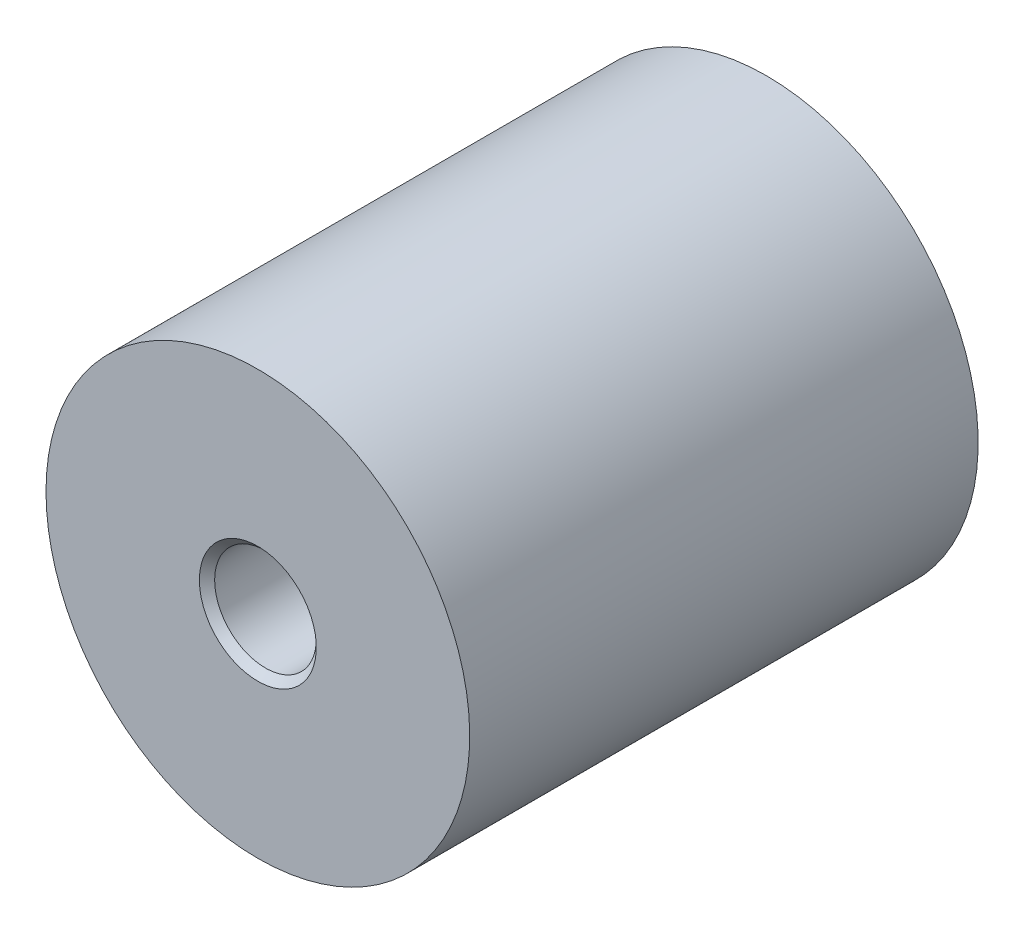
ISO-10303-21;
HEADER;
FILE_DESCRIPTION(('STEP AP214'),'2;1');
FILE_NAME('part.step','',(''),(''),'','','');
FILE_SCHEMA(('AUTOMOTIVE_DESIGN { 1 0 10303 214 1 1 1 1 }'));
ENDSEC;
DATA;
#1=APPLICATION_CONTEXT('core data for automotive mechanical design processes');
#2=APPLICATION_PROTOCOL_DEFINITION('international standard','automotive_design',2000,#1);
#3=PRODUCT_CONTEXT('',#1,'mechanical');
#4=PRODUCT('Part','Part','',(#3));
#5=PRODUCT_RELATED_PRODUCT_CATEGORY('part','',(#4));
#6=PRODUCT_DEFINITION_FORMATION('','',#4);
#7=PRODUCT_DEFINITION_CONTEXT('part definition',#1,'design');
#8=PRODUCT_DEFINITION('design','',#6,#7);
#9=PRODUCT_DEFINITION_SHAPE('','',#8);
#10=(LENGTH_UNIT() NAMED_UNIT(*) SI_UNIT(.MILLI.,.METRE.));
#11=(NAMED_UNIT(*) PLANE_ANGLE_UNIT() SI_UNIT($,.RADIAN.));
#12=(NAMED_UNIT(*) SI_UNIT($,.STERADIAN.) SOLID_ANGLE_UNIT());
#13=UNCERTAINTY_MEASURE_WITH_UNIT(LENGTH_MEASURE(1.E-05),#10,'distance_accuracy_value','');
#14=(GEOMETRIC_REPRESENTATION_CONTEXT(3) GLOBAL_UNCERTAINTY_ASSIGNED_CONTEXT((#13)) GLOBAL_UNIT_ASSIGNED_CONTEXT((#10,
#11,#12)) REPRESENTATION_CONTEXT('',''));
#15=CARTESIAN_POINT('',(0.,0.,0.));
#16=DIRECTION('',(0.,0.,1.));
#17=DIRECTION('',(1.,0.,0.));
#18=AXIS2_PLACEMENT_3D('',#15,#16,#17);
#19=CARTESIAN_POINT('',(0.,0.,0.66666666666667));
#20=DIRECTION('',(0.,0.,1.));
#21=DIRECTION('',(0.,-1.,0.));
#22=AXIS2_PLACEMENT_3D('',#19,#20,#21);
#23=CYLINDRICAL_SURFACE('',#22,12.5);
#24=CARTESIAN_POINT('',(0.,0.,0.));
#25=DIRECTION('',(0.,0.,1.));
#26=DIRECTION('',(0.,-1.,0.));
#27=AXIS2_PLACEMENT_3D('',#24,#25,#26);
#28=CIRCLE('',#27,12.5);
#29=CARTESIAN_POINT('',(0.,-12.5,0.));
#30=VERTEX_POINT('',#29);
#31=EDGE_CURVE('E23',#30,#30,#28,.T.);
#32=ORIENTED_EDGE('',*,*,#31,.T.);
#33=EDGE_LOOP('',(#32));
#34=FACE_BOUND('',#33,.T.);
#35=CARTESIAN_POINT('',(0.,0.,30.));
#36=DIRECTION('',(0.,0.,-1.));
#37=DIRECTION('',(-1.,0.,0.));
#38=AXIS2_PLACEMENT_3D('',#35,#36,#37);
#39=CIRCLE('',#38,12.5);
#40=CARTESIAN_POINT('',(-12.5,0.,30.));
#41=VERTEX_POINT('',#40);
#42=EDGE_CURVE('E32',#41,#41,#39,.T.);
#43=ORIENTED_EDGE('',*,*,#42,.T.);
#44=EDGE_LOOP('',(#43));
#45=FACE_BOUND('',#44,.T.);
#46=ADVANCED_FACE('F12',(#34,#45),#23,.T.);
#47=CARTESIAN_POINT('',(12.5,0.,0.));
#48=DIRECTION('',(0.,0.,-1.));
#49=DIRECTION('',(0.,1.,0.));
#50=AXIS2_PLACEMENT_3D('',#47,#48,#49);
#51=PLANE('',#50);
#52=CARTESIAN_POINT('',(0.,0.,0.));
#53=DIRECTION('',(0.,0.,-1.));
#54=DIRECTION('',(0.,1.,0.));
#55=AXIS2_PLACEMENT_3D('',#52,#53,#54);
#56=CIRCLE('',#55,3.45);
#57=CARTESIAN_POINT('',(0.,3.45,0.));
#58=VERTEX_POINT('',#57);
#59=EDGE_CURVE('E8',#58,#58,#56,.F.);
#60=ORIENTED_EDGE('',*,*,#59,.T.);
#61=EDGE_LOOP('',(#60));
#62=FACE_BOUND('',#61,.T.);
#63=ORIENTED_EDGE('',*,*,#31,.F.);
#64=EDGE_LOOP('',(#63));
#65=FACE_BOUND('',#64,.T.);
#66=ADVANCED_FACE('F58',(#62,#65),#51,.T.);
#67=CARTESIAN_POINT('',(0.,0.,0.));
#68=DIRECTION('',(0.,0.,1.));
#69=DIRECTION('',(0.,-1.,0.));
#70=AXIS2_PLACEMENT_3D('',#67,#68,#69);
#71=CYLINDRICAL_SURFACE('',#70,3.);
#72=CARTESIAN_POINT('',(0.,0.,0.45));
#73=DIRECTION('',(0.,0.,-1.));
#74=DIRECTION('',(0.,1.,0.));
#75=AXIS2_PLACEMENT_3D('',#72,#73,#74);
#76=CIRCLE('',#75,3.);
#77=CARTESIAN_POINT('',(0.,3.,0.45));
#78=VERTEX_POINT('',#77);
#79=EDGE_CURVE('E19',#78,#78,#76,.T.);
#80=ORIENTED_EDGE('',*,*,#79,.T.);
#81=EDGE_LOOP('',(#80));
#82=FACE_BOUND('',#81,.T.);
#83=CARTESIAN_POINT('',(0.,0.,6.));
#84=DIRECTION('',(0.,0.,-1.));
#85=DIRECTION('',(0.,1.,0.));
#86=AXIS2_PLACEMENT_3D('',#83,#84,#85);
#87=CIRCLE('',#86,3.);
#88=CARTESIAN_POINT('',(0.,3.,6.));
#89=VERTEX_POINT('',#88);
#90=EDGE_CURVE('E27',#89,#89,#87,.T.);
#91=ORIENTED_EDGE('',*,*,#90,.F.);
#92=EDGE_LOOP('',(#91));
#93=FACE_BOUND('',#92,.T.);
#94=ADVANCED_FACE('F63',(#82,#93),#71,.F.);
#95=CARTESIAN_POINT('',(0.,0.,6.));
#96=DIRECTION('',(0.,0.,-1.));
#97=DIRECTION('',(0.,1.,0.));
#98=AXIS2_PLACEMENT_3D('',#95,#96,#97);
#99=PLANE('',#98);
#100=ORIENTED_EDGE('',*,*,#90,.T.);
#101=EDGE_LOOP('',(#100));
#102=FACE_BOUND('',#101,.T.);
#103=ADVANCED_FACE('F69',(#102),#99,.T.);
#104=CARTESIAN_POINT('',(0.,0.,0.45));
#105=DIRECTION('',(0.,0.,-1.));
#106=DIRECTION('',(0.,1.,0.));
#107=AXIS2_PLACEMENT_3D('',#104,#105,#106);
#108=CONICAL_SURFACE('',#107,3.,0.785398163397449);
#109=ORIENTED_EDGE('',*,*,#59,.F.);
#110=EDGE_LOOP('',(#109));
#111=FACE_BOUND('',#110,.T.);
#112=ORIENTED_EDGE('',*,*,#79,.F.);
#113=EDGE_LOOP('',(#112));
#114=FACE_BOUND('',#113,.T.);
#115=ADVANCED_FACE('F14',(#111,#114),#108,.F.);
#116=CARTESIAN_POINT('',(0.,12.5,30.));
#117=DIRECTION('',(0.,0.,1.));
#118=DIRECTION('',(1.,0.,0.));
#119=AXIS2_PLACEMENT_3D('',#116,#117,#118);
#120=PLANE('',#119);
#121=CARTESIAN_POINT('',(0.,0.,30.));
#122=DIRECTION('',(0.,0.,-1.));
#123=DIRECTION('',(-1.,0.,0.));
#124=AXIS2_PLACEMENT_3D('',#121,#122,#123);
#125=CIRCLE('',#124,3.45);
#126=CARTESIAN_POINT('',(-3.45,0.,30.));
#127=VERTEX_POINT('',#126);
#128=EDGE_CURVE('E35',#127,#127,#125,.T.);
#129=ORIENTED_EDGE('',*,*,#128,.T.);
#130=EDGE_LOOP('',(#129));
#131=FACE_BOUND('',#130,.T.);
#132=ORIENTED_EDGE('',*,*,#42,.F.);
#133=EDGE_LOOP('',(#132));
#134=FACE_BOUND('',#133,.T.);
#135=ADVANCED_FACE('F73',(#131,#134),#120,.T.);
#136=CARTESIAN_POINT('',(0.,0.,30.));
#137=DIRECTION('',(0.,0.,1.));
#138=DIRECTION('',(1.,0.,0.));
#139=AXIS2_PLACEMENT_3D('',#136,#137,#138);
#140=CONICAL_SURFACE('',#139,3.45,0.785398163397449);
#141=CARTESIAN_POINT('',(0.,0.,29.55));
#142=DIRECTION('',(0.,0.,-1.));
#143=DIRECTION('',(-1.,0.,0.));
#144=AXIS2_PLACEMENT_3D('',#141,#142,#143);
#145=CIRCLE('',#144,3.);
#146=CARTESIAN_POINT('',(-3.,0.,29.55));
#147=VERTEX_POINT('',#146);
#148=EDGE_CURVE('E38',#147,#147,#145,.T.);
#149=ORIENTED_EDGE('',*,*,#148,.T.);
#150=EDGE_LOOP('',(#149));
#151=FACE_BOUND('',#150,.T.);
#152=ORIENTED_EDGE('',*,*,#128,.F.);
#153=EDGE_LOOP('',(#152));
#154=FACE_BOUND('',#153,.T.);
#155=ADVANCED_FACE('F55',(#151,#154),#140,.F.);
#156=CARTESIAN_POINT('',(0.,0.,0.));
#157=DIRECTION('',(0.,0.,-1.));
#158=DIRECTION('',(-1.,0.,0.));
#159=AXIS2_PLACEMENT_3D('',#156,#157,#158);
#160=CYLINDRICAL_SURFACE('',#159,3.);
#161=CARTESIAN_POINT('',(0.,0.,24.));
#162=DIRECTION('',(0.,0.,-1.));
#163=DIRECTION('',(-1.,0.,0.));
#164=AXIS2_PLACEMENT_3D('',#161,#162,#163);
#165=CIRCLE('',#164,3.);
#166=CARTESIAN_POINT('',(-3.,0.,24.));
#167=VERTEX_POINT('',#166);
#168=EDGE_CURVE('E41',#167,#167,#165,.T.);
#169=ORIENTED_EDGE('',*,*,#168,.T.);
#170=EDGE_LOOP('',(#169));
#171=FACE_BOUND('',#170,.T.);
#172=ORIENTED_EDGE('',*,*,#148,.F.);
#173=EDGE_LOOP('',(#172));
#174=FACE_BOUND('',#173,.T.);
#175=ADVANCED_FACE('F45',(#171,#174),#160,.F.);
#176=CARTESIAN_POINT('',(0.,3.,24.));
#177=DIRECTION('',(0.,0.,1.));
#178=DIRECTION('',(1.,0.,0.));
#179=AXIS2_PLACEMENT_3D('',#176,#177,#178);
#180=PLANE('',#179);
#181=ORIENTED_EDGE('',*,*,#168,.F.);
#182=EDGE_LOOP('',(#181));
#183=FACE_BOUND('',#182,.T.);
#184=ADVANCED_FACE('F48',(#183),#180,.T.);
#185=CLOSED_SHELL('',(#46,#66,#94,#103,#115,#135,#155,#175,#184));
#186=MANIFOLD_SOLID_BREP('B1',#185);
#187=ADVANCED_BREP_SHAPE_REPRESENTATION('',(#18,#186),#14);
#188=SHAPE_DEFINITION_REPRESENTATION(#9,#187);
ENDSEC;
END-ISO-10303-21;
